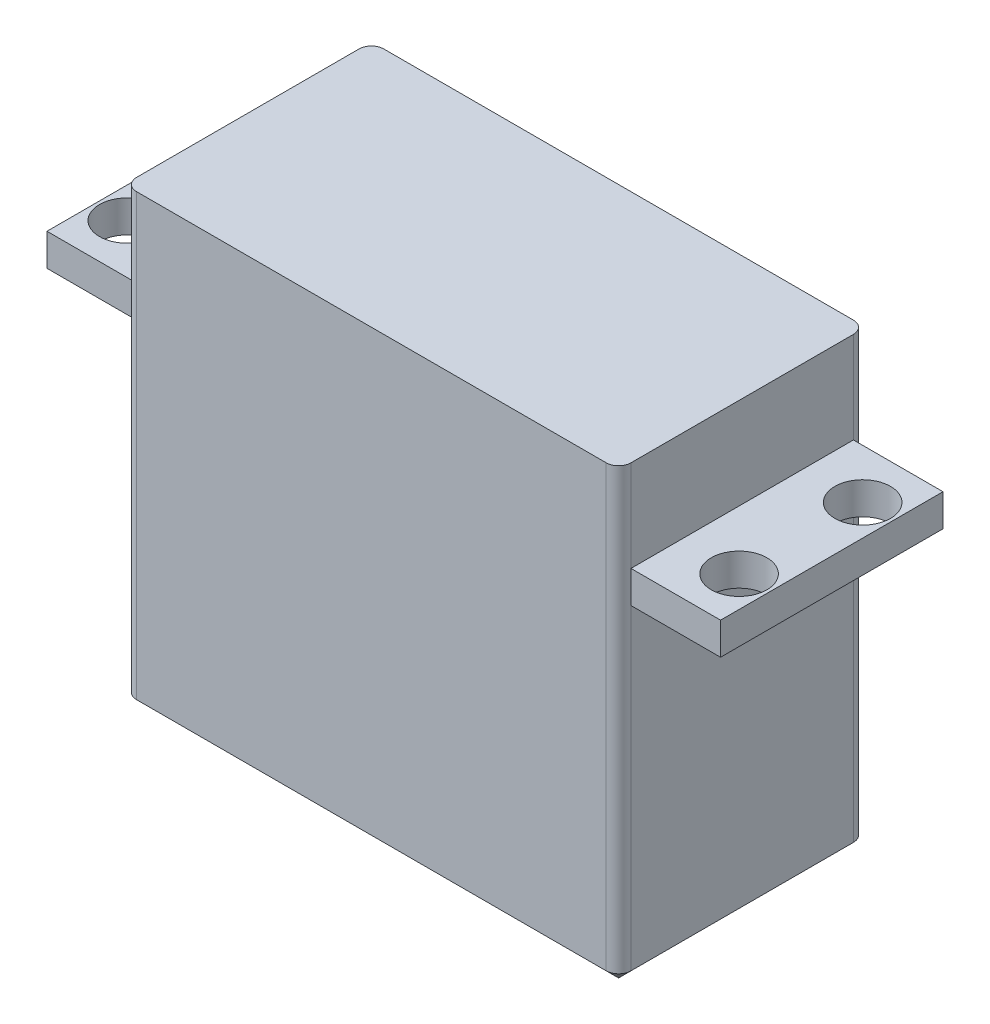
ISO-10303-21;
HEADER;
FILE_DESCRIPTION(('STEP AP214'),'2;1');
FILE_NAME('part.step','',(''),(''),'','','');
FILE_SCHEMA(('AUTOMOTIVE_DESIGN { 1 0 10303 214 1 1 1 1 }'));
ENDSEC;
DATA;
#1=APPLICATION_CONTEXT('core data for automotive mechanical design processes');
#2=APPLICATION_PROTOCOL_DEFINITION('international standard','automotive_design',2000,#1);
#3=PRODUCT_CONTEXT('',#1,'mechanical');
#4=PRODUCT('Part','Part','',(#3));
#5=PRODUCT_RELATED_PRODUCT_CATEGORY('part','',(#4));
#6=PRODUCT_DEFINITION_FORMATION('','',#4);
#7=PRODUCT_DEFINITION_CONTEXT('part definition',#1,'design');
#8=PRODUCT_DEFINITION('design','',#6,#7);
#9=PRODUCT_DEFINITION_SHAPE('','',#8);
#10=(LENGTH_UNIT() NAMED_UNIT(*) SI_UNIT(.MILLI.,.METRE.));
#11=(NAMED_UNIT(*) PLANE_ANGLE_UNIT() SI_UNIT($,.RADIAN.));
#12=(NAMED_UNIT(*) SI_UNIT($,.STERADIAN.) SOLID_ANGLE_UNIT());
#13=UNCERTAINTY_MEASURE_WITH_UNIT(LENGTH_MEASURE(1.E-05),#10,'distance_accuracy_value','');
#14=(GEOMETRIC_REPRESENTATION_CONTEXT(3) GLOBAL_UNCERTAINTY_ASSIGNED_CONTEXT((#13)) GLOBAL_UNIT_ASSIGNED_CONTEXT((#10,
#11,#12)) REPRESENTATION_CONTEXT('',''));
#15=CARTESIAN_POINT('',(0.,0.,0.));
#16=DIRECTION('',(0.,0.,1.));
#17=DIRECTION('',(1.,0.,0.));
#18=AXIS2_PLACEMENT_3D('',#15,#16,#17);
#19=CARTESIAN_POINT('',(-20.,36.6,-10.));
#20=DIRECTION('',(1.,0.,0.));
#21=DIRECTION('',(0.,0.,-1.));
#22=AXIS2_PLACEMENT_3D('',#19,#20,#21);
#23=PLANE('',#22);
#24=DIRECTION('',(0.,0.,1.));
#25=VECTOR('',#24,1.);
#26=CARTESIAN_POINT('',(-20.,36.6,-10.));
#27=LINE('',#26,#25);
#28=CARTESIAN_POINT('',(-20.,36.6,-9.));
#29=VERTEX_POINT('',#28);
#30=CARTESIAN_POINT('',(-20.,36.6,9.));
#31=VERTEX_POINT('',#30);
#32=EDGE_CURVE('E260',#29,#31,#27,.T.);
#33=ORIENTED_EDGE('',*,*,#32,.F.);
#34=DIRECTION('',(0.,-1.,0.));
#35=VECTOR('',#34,1.);
#36=CARTESIAN_POINT('',(-20.,36.6,-9.));
#37=LINE('',#36,#35);
#38=CARTESIAN_POINT('',(-20.,29.2,-9.));
#39=VERTEX_POINT('',#38);
#40=EDGE_CURVE('E307',#29,#39,#37,.T.);
#41=ORIENTED_EDGE('',*,*,#40,.T.);
#42=DIRECTION('',(0.,0.,1.));
#43=VECTOR('',#42,1.);
#44=CARTESIAN_POINT('',(-20.,29.2,9.));
#45=LINE('',#44,#43);
#46=CARTESIAN_POINT('',(-20.,29.2,9.));
#47=VERTEX_POINT('',#46);
#48=EDGE_CURVE('E198',#39,#47,#45,.T.);
#49=ORIENTED_EDGE('',*,*,#48,.T.);
#50=DIRECTION('',(0.,-1.,0.));
#51=VECTOR('',#50,1.);
#52=CARTESIAN_POINT('',(-20.,36.6,9.));
#53=LINE('',#52,#51);
#54=EDGE_CURVE('E300',#47,#31,#53,.F.);
#55=ORIENTED_EDGE('',*,*,#54,.T.);
#56=EDGE_LOOP('',(#33,#41,#49,#55));
#57=FACE_BOUND('',#56,.T.);
#58=ADVANCED_FACE('F35',(#57),#23,.F.);
#59=CARTESIAN_POINT('',(20.,36.6,-10.));
#60=DIRECTION('',(-1.,0.,0.));
#61=DIRECTION('',(0.,0.,1.));
#62=AXIS2_PLACEMENT_3D('',#59,#60,#61);
#63=PLANE('',#62);
#64=DIRECTION('',(0.,0.,-1.));
#65=VECTOR('',#64,1.);
#66=CARTESIAN_POINT('',(20.,36.6,-10.));
#67=LINE('',#66,#65);
#68=CARTESIAN_POINT('',(20.,36.6,9.));
#69=VERTEX_POINT('',#68);
#70=CARTESIAN_POINT('',(20.,36.6,-9.));
#71=VERTEX_POINT('',#70);
#72=EDGE_CURVE('E254',#69,#71,#67,.T.);
#73=ORIENTED_EDGE('',*,*,#72,.F.);
#74=DIRECTION('',(0.,-1.,0.));
#75=VECTOR('',#74,1.);
#76=CARTESIAN_POINT('',(20.,36.6,9.));
#77=LINE('',#76,#75);
#78=CARTESIAN_POINT('',(20.,29.2,9.));
#79=VERTEX_POINT('',#78);
#80=EDGE_CURVE('E280',#69,#79,#77,.T.);
#81=ORIENTED_EDGE('',*,*,#80,.T.);
#82=DIRECTION('',(0.,0.,1.));
#83=VECTOR('',#82,1.);
#84=CARTESIAN_POINT('',(20.,29.2,9.));
#85=LINE('',#84,#83);
#86=CARTESIAN_POINT('',(20.,29.2,-9.00000000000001));
#87=VERTEX_POINT('',#86);
#88=EDGE_CURVE('E226',#87,#79,#85,.T.);
#89=ORIENTED_EDGE('',*,*,#88,.F.);
#90=DIRECTION('',(0.,-1.,0.));
#91=VECTOR('',#90,1.);
#92=CARTESIAN_POINT('',(20.,36.6,-9.));
#93=LINE('',#92,#91);
#94=EDGE_CURVE('E266',#87,#71,#93,.F.);
#95=ORIENTED_EDGE('',*,*,#94,.T.);
#96=EDGE_LOOP('',(#73,#81,#89,#95));
#97=FACE_BOUND('',#96,.T.);
#98=ADVANCED_FACE('F381',(#97),#63,.F.);
#99=CARTESIAN_POINT('',(-27.25,29.2,8.99999999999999));
#100=DIRECTION('',(0.,1.,0.));
#101=DIRECTION('',(0.,0.,1.));
#102=AXIS2_PLACEMENT_3D('',#99,#100,#101);
#103=PLANE('',#102);
#104=CARTESIAN_POINT('',(-24.75,29.2,5.));
#105=DIRECTION('',(0.,1.,0.));
#106=DIRECTION('',(0.,0.,-1.));
#107=AXIS2_PLACEMENT_3D('',#104,#105,#106);
#108=CIRCLE('',#107,2.25);
#109=CARTESIAN_POINT('',(-24.75,29.2,7.25));
#110=VERTEX_POINT('',#109);
#111=EDGE_CURVE('E273',#110,#110,#108,.T.);
#112=ORIENTED_EDGE('',*,*,#111,.F.);
#113=EDGE_LOOP('',(#112));
#114=FACE_BOUND('',#113,.T.);
#115=ORIENTED_EDGE('',*,*,#48,.F.);
#116=DIRECTION('',(1.,0.,0.));
#117=VECTOR('',#116,1.);
#118=CARTESIAN_POINT('',(-27.25,29.2,-9.00000000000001));
#119=LINE('',#118,#117);
#120=CARTESIAN_POINT('',(-27.25,29.2,-9.00000000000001));
#121=VERTEX_POINT('',#120);
#122=EDGE_CURVE('E175',#121,#39,#119,.T.);
#123=ORIENTED_EDGE('',*,*,#122,.F.);
#124=DIRECTION('',(0.,0.,1.));
#125=VECTOR('',#124,1.);
#126=CARTESIAN_POINT('',(-27.25,29.2,8.99999999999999));
#127=LINE('',#126,#125);
#128=CARTESIAN_POINT('',(-27.25,29.2,8.99999999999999));
#129=VERTEX_POINT('',#128);
#130=EDGE_CURVE('E181',#121,#129,#127,.T.);
#131=ORIENTED_EDGE('',*,*,#130,.T.);
#132=DIRECTION('',(1.,0.,0.));
#133=VECTOR('',#132,1.);
#134=CARTESIAN_POINT('',(-27.25,29.2,8.99999999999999));
#135=LINE('',#134,#133);
#136=EDGE_CURVE('E162',#129,#47,#135,.T.);
#137=ORIENTED_EDGE('',*,*,#136,.T.);
#138=EDGE_LOOP('',(#115,#123,#131,#137));
#139=FACE_BOUND('',#138,.T.);
#140=CARTESIAN_POINT('',(-24.75,29.2,-5.));
#141=DIRECTION('',(0.,-1.,0.));
#142=DIRECTION('',(0.,0.,1.));
#143=AXIS2_PLACEMENT_3D('',#140,#141,#142);
#144=CIRCLE('',#143,2.25);
#145=CARTESIAN_POINT('',(-24.75,29.2,-2.75));
#146=VERTEX_POINT('',#145);
#147=EDGE_CURVE('E269',#146,#146,#144,.T.);
#148=ORIENTED_EDGE('',*,*,#147,.T.);
#149=EDGE_LOOP('',(#148));
#150=FACE_BOUND('',#149,.T.);
#151=ADVANCED_FACE('F187',(#114,#139,#150),#103,.T.);
#152=CARTESIAN_POINT('',(-27.25,26.6,8.99999999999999));
#153=DIRECTION('',(0.,-1.,0.));
#154=DIRECTION('',(0.,0.,-1.));
#155=AXIS2_PLACEMENT_3D('',#152,#153,#154);
#156=PLANE('',#155);
#157=CARTESIAN_POINT('',(-24.75,26.6,5.));
#158=DIRECTION('',(0.,-1.,0.));
#159=DIRECTION('',(0.,0.,-1.));
#160=AXIS2_PLACEMENT_3D('',#157,#158,#159);
#161=CIRCLE('',#160,2.25);
#162=CARTESIAN_POINT('',(-24.75,26.6,7.25));
#163=VERTEX_POINT('',#162);
#164=EDGE_CURVE('E270',#163,#163,#161,.T.);
#165=ORIENTED_EDGE('',*,*,#164,.F.);
#166=EDGE_LOOP('',(#165));
#167=FACE_BOUND('',#166,.T.);
#168=DIRECTION('',(0.,0.,-1.));
#169=VECTOR('',#168,1.);
#170=CARTESIAN_POINT('',(-20.,26.6,9.));
#171=LINE('',#170,#169);
#172=CARTESIAN_POINT('',(-20.,26.6,9.));
#173=VERTEX_POINT('',#172);
#174=CARTESIAN_POINT('',(-20.,26.6,-9.00000000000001));
#175=VERTEX_POINT('',#174);
#176=EDGE_CURVE('E185',#173,#175,#171,.T.);
#177=ORIENTED_EDGE('',*,*,#176,.F.);
#178=DIRECTION('',(1.,0.,0.));
#179=VECTOR('',#178,1.);
#180=CARTESIAN_POINT('',(-27.25,26.6,8.99999999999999));
#181=LINE('',#180,#179);
#182=CARTESIAN_POINT('',(-27.25,26.6,8.99999999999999));
#183=VERTEX_POINT('',#182);
#184=EDGE_CURVE('E196',#183,#173,#181,.T.);
#185=ORIENTED_EDGE('',*,*,#184,.F.);
#186=DIRECTION('',(0.,0.,-1.));
#187=VECTOR('',#186,1.);
#188=CARTESIAN_POINT('',(-27.25,26.6,8.99999999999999));
#189=LINE('',#188,#187);
#190=CARTESIAN_POINT('',(-27.25,26.6,-9.00000000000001));
#191=VERTEX_POINT('',#190);
#192=EDGE_CURVE('E184',#183,#191,#189,.T.);
#193=ORIENTED_EDGE('',*,*,#192,.T.);
#194=DIRECTION('',(1.,0.,0.));
#195=VECTOR('',#194,1.);
#196=CARTESIAN_POINT('',(-27.25,26.6,-9.00000000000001));
#197=LINE('',#196,#195);
#198=EDGE_CURVE('E206',#191,#175,#197,.T.);
#199=ORIENTED_EDGE('',*,*,#198,.T.);
#200=EDGE_LOOP('',(#177,#185,#193,#199));
#201=FACE_BOUND('',#200,.T.);
#202=CARTESIAN_POINT('',(-24.75,26.6,-5.));
#203=DIRECTION('',(0.,-1.,0.));
#204=DIRECTION('',(0.,0.,-1.));
#205=AXIS2_PLACEMENT_3D('',#202,#203,#204);
#206=CIRCLE('',#205,2.25);
#207=CARTESIAN_POINT('',(-24.75,26.6,-2.75));
#208=VERTEX_POINT('',#207);
#209=EDGE_CURVE('E199',#208,#208,#206,.F.);
#210=ORIENTED_EDGE('',*,*,#209,.T.);
#211=EDGE_LOOP('',(#210));
#212=FACE_BOUND('',#211,.T.);
#213=ADVANCED_FACE('F471',(#167,#201,#212),#156,.T.);
#214=CARTESIAN_POINT('',(27.25,26.6,8.99999999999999));
#215=DIRECTION('',(0.,1.,0.));
#216=DIRECTION('',(0.,0.,1.));
#217=AXIS2_PLACEMENT_3D('',#214,#215,#216);
#218=PLANE('',#217);
#219=DIRECTION('',(0.,0.,-1.));
#220=VECTOR('',#219,1.);
#221=CARTESIAN_POINT('',(20.,26.6,9.));
#222=LINE('',#221,#220);
#223=CARTESIAN_POINT('',(20.,26.6,8.99999999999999));
#224=VERTEX_POINT('',#223);
#225=CARTESIAN_POINT('',(20.,26.6,-9.));
#226=VERTEX_POINT('',#225);
#227=EDGE_CURVE('E235',#224,#226,#222,.T.);
#228=ORIENTED_EDGE('',*,*,#227,.T.);
#229=DIRECTION('',(-1.,0.,0.));
#230=VECTOR('',#229,1.);
#231=CARTESIAN_POINT('',(27.25,26.6,-9.00000000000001));
#232=LINE('',#231,#230);
#233=CARTESIAN_POINT('',(27.25,26.6,-9.00000000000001));
#234=VERTEX_POINT('',#233);
#235=EDGE_CURVE('E248',#234,#226,#232,.T.);
#236=ORIENTED_EDGE('',*,*,#235,.F.);
#237=DIRECTION('',(0.,0.,-1.));
#238=VECTOR('',#237,1.);
#239=CARTESIAN_POINT('',(27.25,26.6,8.99999999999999));
#240=LINE('',#239,#238);
#241=CARTESIAN_POINT('',(27.25,26.6,8.99999999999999));
#242=VERTEX_POINT('',#241);
#243=EDGE_CURVE('E225',#242,#234,#240,.T.);
#244=ORIENTED_EDGE('',*,*,#243,.F.);
#245=DIRECTION('',(-1.,0.,0.));
#246=VECTOR('',#245,1.);
#247=CARTESIAN_POINT('',(27.25,26.6,8.99999999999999));
#248=LINE('',#247,#246);
#249=EDGE_CURVE('E251',#242,#224,#248,.T.);
#250=ORIENTED_EDGE('',*,*,#249,.T.);
#251=EDGE_LOOP('',(#228,#236,#244,#250));
#252=FACE_BOUND('',#251,.T.);
#253=CARTESIAN_POINT('',(24.75,26.6,-5.));
#254=DIRECTION('',(0.,1.,0.));
#255=DIRECTION('',(0.,0.,1.));
#256=AXIS2_PLACEMENT_3D('',#253,#254,#255);
#257=CIRCLE('',#256,2.25);
#258=CARTESIAN_POINT('',(24.75,26.6,-2.75));
#259=VERTEX_POINT('',#258);
#260=EDGE_CURVE('E218',#259,#259,#257,.T.);
#261=ORIENTED_EDGE('',*,*,#260,.T.);
#262=EDGE_LOOP('',(#261));
#263=FACE_BOUND('',#262,.T.);
#264=CARTESIAN_POINT('',(24.75,26.6,5.));
#265=DIRECTION('',(0.,1.,0.));
#266=DIRECTION('',(0.,0.,1.));
#267=AXIS2_PLACEMENT_3D('',#264,#265,#266);
#268=CIRCLE('',#267,2.25);
#269=CARTESIAN_POINT('',(24.75,26.6,7.25));
#270=VERTEX_POINT('',#269);
#271=EDGE_CURVE('E212',#270,#270,#268,.F.);
#272=ORIENTED_EDGE('',*,*,#271,.F.);
#273=EDGE_LOOP('',(#272));
#274=FACE_BOUND('',#273,.T.);
#275=ADVANCED_FACE('F468',(#252,#263,#274),#218,.F.);
#276=CARTESIAN_POINT('',(27.25,29.2,8.99999999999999));
#277=DIRECTION('',(0.,-1.,0.));
#278=DIRECTION('',(0.,0.,-1.));
#279=AXIS2_PLACEMENT_3D('',#276,#277,#278);
#280=PLANE('',#279);
#281=ORIENTED_EDGE('',*,*,#88,.T.);
#282=DIRECTION('',(-1.,0.,0.));
#283=VECTOR('',#282,1.);
#284=CARTESIAN_POINT('',(27.25,29.2,8.99999999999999));
#285=LINE('',#284,#283);
#286=CARTESIAN_POINT('',(27.25,29.2,8.99999999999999));
#287=VERTEX_POINT('',#286);
#288=EDGE_CURVE('E232',#287,#79,#285,.T.);
#289=ORIENTED_EDGE('',*,*,#288,.F.);
#290=DIRECTION('',(0.,0.,1.));
#291=VECTOR('',#290,1.);
#292=CARTESIAN_POINT('',(27.25,29.2,8.99999999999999));
#293=LINE('',#292,#291);
#294=CARTESIAN_POINT('',(27.25,29.2,-9.00000000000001));
#295=VERTEX_POINT('',#294);
#296=EDGE_CURVE('E230',#295,#287,#293,.T.);
#297=ORIENTED_EDGE('',*,*,#296,.F.);
#298=DIRECTION('',(-1.,0.,0.));
#299=VECTOR('',#298,1.);
#300=CARTESIAN_POINT('',(27.25,29.2,-9.00000000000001));
#301=LINE('',#300,#299);
#302=EDGE_CURVE('E245',#295,#87,#301,.T.);
#303=ORIENTED_EDGE('',*,*,#302,.T.);
#304=EDGE_LOOP('',(#281,#289,#297,#303));
#305=FACE_BOUND('',#304,.T.);
#306=CARTESIAN_POINT('',(24.75,29.2,-5.));
#307=DIRECTION('',(0.,1.,0.));
#308=DIRECTION('',(0.,0.,1.));
#309=AXIS2_PLACEMENT_3D('',#306,#307,#308);
#310=CIRCLE('',#309,2.25);
#311=CARTESIAN_POINT('',(24.75,29.2,-2.75));
#312=VERTEX_POINT('',#311);
#313=EDGE_CURVE('E215',#312,#312,#310,.T.);
#314=ORIENTED_EDGE('',*,*,#313,.F.);
#315=EDGE_LOOP('',(#314));
#316=FACE_BOUND('',#315,.T.);
#317=CARTESIAN_POINT('',(24.75,29.2,5.));
#318=DIRECTION('',(0.,-1.,0.));
#319=DIRECTION('',(0.,0.,-1.));
#320=AXIS2_PLACEMENT_3D('',#317,#318,#319);
#321=CIRCLE('',#320,2.25);
#322=CARTESIAN_POINT('',(24.75,29.2,7.25));
#323=VERTEX_POINT('',#322);
#324=EDGE_CURVE('E174',#323,#323,#321,.T.);
#325=ORIENTED_EDGE('',*,*,#324,.T.);
#326=EDGE_LOOP('',(#325));
#327=FACE_BOUND('',#326,.T.);
#328=ADVANCED_FACE('F428',(#305,#316,#327),#280,.F.);
#329=DIRECTION('',(0.,-1.,0.));
#330=VECTOR('',#329,1.);
#331=CARTESIAN_POINT('',(20.,36.6,9.));
#332=LINE('',#331,#330);
#333=CARTESIAN_POINT('',(20.,1.,9.));
#334=VERTEX_POINT('',#333);
#335=EDGE_CURVE('E277',#224,#334,#332,.T.);
#336=ORIENTED_EDGE('',*,*,#335,.T.);
#337=DIRECTION('',(0.,0.,-1.));
#338=VECTOR('',#337,1.);
#339=CARTESIAN_POINT('',(20.,1.00000000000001,-10.));
#340=LINE('',#339,#338);
#341=CARTESIAN_POINT('',(20.,1.,-9.));
#342=VERTEX_POINT('',#341);
#343=EDGE_CURVE('E310',#334,#342,#340,.T.);
#344=ORIENTED_EDGE('',*,*,#343,.T.);
#345=DIRECTION('',(0.,-1.,0.));
#346=VECTOR('',#345,1.);
#347=CARTESIAN_POINT('',(20.,36.6,-9.));
#348=LINE('',#347,#346);
#349=EDGE_CURVE('E275',#342,#226,#348,.F.);
#350=ORIENTED_EDGE('',*,*,#349,.T.);
#351=ORIENTED_EDGE('',*,*,#227,.F.);
#352=EDGE_LOOP('',(#336,#344,#350,#351));
#353=FACE_BOUND('',#352,.T.);
#354=ADVANCED_FACE('F390',(#353),#63,.F.);
#355=CARTESIAN_POINT('',(-20.,36.6,-10.));
#356=DIRECTION('',(0.,0.,1.));
#357=DIRECTION('',(1.,0.,0.));
#358=AXIS2_PLACEMENT_3D('',#355,#356,#357);
#359=PLANE('',#358);
#360=DIRECTION('',(0.,-1.,0.));
#361=VECTOR('',#360,1.);
#362=CARTESIAN_POINT('',(19.,36.6,-10.));
#363=LINE('',#362,#361);
#364=CARTESIAN_POINT('',(19.,36.6,-10.));
#365=VERTEX_POINT('',#364);
#366=CARTESIAN_POINT('',(19.,1.,-10.));
#367=VERTEX_POINT('',#366);
#368=EDGE_CURVE('E298',#365,#367,#363,.T.);
#369=ORIENTED_EDGE('',*,*,#368,.T.);
#370=DIRECTION('',(-1.,0.,0.));
#371=VECTOR('',#370,1.);
#372=CARTESIAN_POINT('',(-20.,1.,-10.));
#373=LINE('',#372,#371);
#374=CARTESIAN_POINT('',(-19.,1.,-10.));
#375=VERTEX_POINT('',#374);
#376=EDGE_CURVE('E11',#367,#375,#373,.T.);
#377=ORIENTED_EDGE('',*,*,#376,.T.);
#378=DIRECTION('',(0.,-1.,0.));
#379=VECTOR('',#378,1.);
#380=CARTESIAN_POINT('',(-19.,36.6,-10.));
#381=LINE('',#380,#379);
#382=CARTESIAN_POINT('',(-19.,36.6,-10.));
#383=VERTEX_POINT('',#382);
#384=EDGE_CURVE('E296',#375,#383,#381,.F.);
#385=ORIENTED_EDGE('',*,*,#384,.T.);
#386=DIRECTION('',(-1.,0.,0.));
#387=VECTOR('',#386,1.);
#388=CARTESIAN_POINT('',(-20.,36.6,-10.));
#389=LINE('',#388,#387);
#390=EDGE_CURVE('E257',#365,#383,#389,.T.);
#391=ORIENTED_EDGE('',*,*,#390,.F.);
#392=EDGE_LOOP('',(#369,#377,#385,#391));
#393=FACE_BOUND('',#392,.T.);
#394=ADVANCED_FACE('F396',(#393),#359,.F.);
#395=DIRECTION('',(0.,-1.,0.));
#396=VECTOR('',#395,1.);
#397=CARTESIAN_POINT('',(-20.,36.6,-9.));
#398=LINE('',#397,#396);
#399=CARTESIAN_POINT('',(-20.,1.,-9.));
#400=VERTEX_POINT('',#399);
#401=EDGE_CURVE('E304',#175,#400,#398,.T.);
#402=ORIENTED_EDGE('',*,*,#401,.T.);
#403=DIRECTION('',(0.,0.,1.));
#404=VECTOR('',#403,1.);
#405=CARTESIAN_POINT('',(-20.,1.,-10.));
#406=LINE('',#405,#404);
#407=CARTESIAN_POINT('',(-20.,1.,9.));
#408=VERTEX_POINT('',#407);
#409=EDGE_CURVE('E324',#400,#408,#406,.T.);
#410=ORIENTED_EDGE('',*,*,#409,.T.);
#411=DIRECTION('',(0.,-1.,0.));
#412=VECTOR('',#411,1.);
#413=CARTESIAN_POINT('',(-20.,36.6,9.));
#414=LINE('',#413,#412);
#415=EDGE_CURVE('E302',#408,#173,#414,.F.);
#416=ORIENTED_EDGE('',*,*,#415,.T.);
#417=ORIENTED_EDGE('',*,*,#176,.T.);
#418=EDGE_LOOP('',(#402,#410,#416,#417));
#419=FACE_BOUND('',#418,.T.);
#420=ADVANCED_FACE('F384',(#419),#23,.F.);
#421=CARTESIAN_POINT('',(-20.,36.6,10.));
#422=DIRECTION('',(0.,0.,-1.));
#423=DIRECTION('',(-1.,0.,0.));
#424=AXIS2_PLACEMENT_3D('',#421,#422,#423);
#425=PLANE('',#424);
#426=DIRECTION('',(0.,-1.,0.));
#427=VECTOR('',#426,1.);
#428=CARTESIAN_POINT('',(-19.,36.6,10.));
#429=LINE('',#428,#427);
#430=CARTESIAN_POINT('',(-19.,36.6,10.));
#431=VERTEX_POINT('',#430);
#432=CARTESIAN_POINT('',(-19.,1.,10.));
#433=VERTEX_POINT('',#432);
#434=EDGE_CURVE('E283',#431,#433,#429,.T.);
#435=ORIENTED_EDGE('',*,*,#434,.T.);
#436=DIRECTION('',(1.,0.,0.));
#437=VECTOR('',#436,1.);
#438=CARTESIAN_POINT('',(-20.,1.,10.));
#439=LINE('',#438,#437);
#440=CARTESIAN_POINT('',(19.,1.,10.));
#441=VERTEX_POINT('',#440);
#442=EDGE_CURVE('E322',#433,#441,#439,.T.);
#443=ORIENTED_EDGE('',*,*,#442,.T.);
#444=DIRECTION('',(0.,-1.,0.));
#445=VECTOR('',#444,1.);
#446=CARTESIAN_POINT('',(19.,36.6,10.));
#447=LINE('',#446,#445);
#448=CARTESIAN_POINT('',(19.,36.6,10.));
#449=VERTEX_POINT('',#448);
#450=EDGE_CURVE('E286',#441,#449,#447,.F.);
#451=ORIENTED_EDGE('',*,*,#450,.T.);
#452=DIRECTION('',(1.,0.,0.));
#453=VECTOR('',#452,1.);
#454=CARTESIAN_POINT('',(-20.,36.6,10.));
#455=LINE('',#454,#453);
#456=EDGE_CURVE('E263',#431,#449,#455,.T.);
#457=ORIENTED_EDGE('',*,*,#456,.F.);
#458=EDGE_LOOP('',(#435,#443,#451,#457));
#459=FACE_BOUND('',#458,.T.);
#460=ADVANCED_FACE('F395',(#459),#425,.F.);
#461=CARTESIAN_POINT('',(0.,36.6,0.));
#462=DIRECTION('',(0.,1.,0.));
#463=DIRECTION('',(0.,0.,1.));
#464=AXIS2_PLACEMENT_3D('',#461,#462,#463);
#465=PLANE('',#464);
#466=ORIENTED_EDGE('',*,*,#456,.T.);
#467=CARTESIAN_POINT('',(19.,36.6,9.));
#468=DIRECTION('',(0.,1.,0.));
#469=DIRECTION('',(0.,0.,1.));
#470=AXIS2_PLACEMENT_3D('',#467,#468,#469);
#471=CIRCLE('',#470,1.);
#472=EDGE_CURVE('E294',#449,#69,#471,.T.);
#473=ORIENTED_EDGE('',*,*,#472,.T.);
#474=ORIENTED_EDGE('',*,*,#72,.T.);
#475=CARTESIAN_POINT('',(19.,36.6,-9.));
#476=DIRECTION('',(0.,1.,0.));
#477=DIRECTION('',(0.,0.,1.));
#478=AXIS2_PLACEMENT_3D('',#475,#476,#477);
#479=CIRCLE('',#478,1.);
#480=EDGE_CURVE('E292',#71,#365,#479,.T.);
#481=ORIENTED_EDGE('',*,*,#480,.T.);
#482=ORIENTED_EDGE('',*,*,#390,.T.);
#483=CARTESIAN_POINT('',(-19.,36.6,-9.));
#484=DIRECTION('',(0.,1.,0.));
#485=DIRECTION('',(0.,0.,1.));
#486=AXIS2_PLACEMENT_3D('',#483,#484,#485);
#487=CIRCLE('',#486,1.);
#488=EDGE_CURVE('E290',#383,#29,#487,.T.);
#489=ORIENTED_EDGE('',*,*,#488,.T.);
#490=ORIENTED_EDGE('',*,*,#32,.T.);
#491=CARTESIAN_POINT('',(-19.,36.6,9.));
#492=DIRECTION('',(0.,1.,0.));
#493=DIRECTION('',(0.,0.,1.));
#494=AXIS2_PLACEMENT_3D('',#491,#492,#493);
#495=CIRCLE('',#494,1.);
#496=EDGE_CURVE('E288',#31,#431,#495,.T.);
#497=ORIENTED_EDGE('',*,*,#496,.T.);
#498=EDGE_LOOP('',(#466,#473,#474,#481,#482,#489,#490,#497));
#499=FACE_BOUND('',#498,.T.);
#500=ADVANCED_FACE('F402',(#499),#465,.T.);
#501=CARTESIAN_POINT('',(0.,0.,0.));
#502=DIRECTION('',(0.,1.,0.));
#503=DIRECTION('',(0.,0.,1.));
#504=AXIS2_PLACEMENT_3D('',#501,#502,#503);
#505=PLANE('',#504);
#506=DIRECTION('',(1.,0.,0.));
#507=VECTOR('',#506,1.);
#508=CARTESIAN_POINT('',(0.,0.,-8.99999999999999));
#509=LINE('',#508,#507);
#510=CARTESIAN_POINT('',(-19.,0.,-8.99999999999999));
#511=VERTEX_POINT('',#510);
#512=CARTESIAN_POINT('',(19.,0.,-8.99999999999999));
#513=VERTEX_POINT('',#512);
#514=EDGE_CURVE('E313',#511,#513,#509,.T.);
#515=ORIENTED_EDGE('',*,*,#514,.T.);
#516=DIRECTION('',(0.,0.,1.));
#517=VECTOR('',#516,1.);
#518=CARTESIAN_POINT('',(19.,0.,0.));
#519=LINE('',#518,#517);
#520=CARTESIAN_POINT('',(19.,0.,8.99999999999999));
#521=VERTEX_POINT('',#520);
#522=EDGE_CURVE('E319',#513,#521,#519,.T.);
#523=ORIENTED_EDGE('',*,*,#522,.T.);
#524=DIRECTION('',(-1.,0.,0.));
#525=VECTOR('',#524,1.);
#526=CARTESIAN_POINT('',(0.,0.,8.99999999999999));
#527=LINE('',#526,#525);
#528=CARTESIAN_POINT('',(-19.,0.,9.));
#529=VERTEX_POINT('',#528);
#530=EDGE_CURVE('E317',#521,#529,#527,.T.);
#531=ORIENTED_EDGE('',*,*,#530,.T.);
#532=DIRECTION('',(0.,0.,-1.));
#533=VECTOR('',#532,1.);
#534=CARTESIAN_POINT('',(-19.,0.,0.));
#535=LINE('',#534,#533);
#536=EDGE_CURVE('E315',#529,#511,#535,.T.);
#537=ORIENTED_EDGE('',*,*,#536,.T.);
#538=EDGE_LOOP('',(#515,#523,#531,#537));
#539=FACE_BOUND('',#538,.T.);
#540=ADVANCED_FACE('F457',(#539),#505,.F.);
#541=CARTESIAN_POINT('',(27.25,29.2,8.99999999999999));
#542=DIRECTION('',(0.,0.,-1.));
#543=DIRECTION('',(-1.,0.,0.));
#544=AXIS2_PLACEMENT_3D('',#541,#542,#543);
#545=PLANE('',#544);
#546=DIRECTION('',(0.,-1.,0.));
#547=VECTOR('',#546,1.);
#548=CARTESIAN_POINT('',(20.,29.2,9.));
#549=LINE('',#548,#547);
#550=EDGE_CURVE('E221',#79,#224,#549,.T.);
#551=ORIENTED_EDGE('',*,*,#550,.T.);
#552=ORIENTED_EDGE('',*,*,#249,.F.);
#553=DIRECTION('',(0.,-1.,0.));
#554=VECTOR('',#553,1.);
#555=CARTESIAN_POINT('',(27.25,29.2,8.99999999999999));
#556=LINE('',#555,#554);
#557=EDGE_CURVE('E222',#287,#242,#556,.T.);
#558=ORIENTED_EDGE('',*,*,#557,.F.);
#559=ORIENTED_EDGE('',*,*,#288,.T.);
#560=EDGE_LOOP('',(#551,#552,#558,#559));
#561=FACE_BOUND('',#560,.T.);
#562=ADVANCED_FACE('F435',(#561),#545,.F.);
#563=CARTESIAN_POINT('',(27.25,29.2,-9.00000000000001));
#564=DIRECTION('',(0.,0.,1.));
#565=DIRECTION('',(1.,0.,0.));
#566=AXIS2_PLACEMENT_3D('',#563,#564,#565);
#567=PLANE('',#566);
#568=DIRECTION('',(0.,1.,0.));
#569=VECTOR('',#568,1.);
#570=CARTESIAN_POINT('',(20.,29.2,-9.));
#571=LINE('',#570,#569);
#572=EDGE_CURVE('E238',#226,#87,#571,.T.);
#573=ORIENTED_EDGE('',*,*,#572,.T.);
#574=ORIENTED_EDGE('',*,*,#302,.F.);
#575=DIRECTION('',(0.,1.,0.));
#576=VECTOR('',#575,1.);
#577=CARTESIAN_POINT('',(27.25,29.2,-9.00000000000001));
#578=LINE('',#577,#576);
#579=EDGE_CURVE('E228',#234,#295,#578,.T.);
#580=ORIENTED_EDGE('',*,*,#579,.F.);
#581=ORIENTED_EDGE('',*,*,#235,.T.);
#582=EDGE_LOOP('',(#573,#574,#580,#581));
#583=FACE_BOUND('',#582,.T.);
#584=ADVANCED_FACE('F442',(#583),#567,.F.);
#585=CARTESIAN_POINT('',(27.25,0.,0.));
#586=DIRECTION('',(1.,0.,0.));
#587=DIRECTION('',(0.,0.,-1.));
#588=AXIS2_PLACEMENT_3D('',#585,#586,#587);
#589=PLANE('',#588);
#590=ORIENTED_EDGE('',*,*,#557,.T.);
#591=ORIENTED_EDGE('',*,*,#243,.T.);
#592=ORIENTED_EDGE('',*,*,#579,.T.);
#593=ORIENTED_EDGE('',*,*,#296,.T.);
#594=EDGE_LOOP('',(#590,#591,#592,#593));
#595=FACE_BOUND('',#594,.T.);
#596=ADVANCED_FACE('F438',(#595),#589,.T.);
#597=CARTESIAN_POINT('',(24.75,0.,-5.));
#598=DIRECTION('',(0.,1.,0.));
#599=DIRECTION('',(0.,0.,1.));
#600=AXIS2_PLACEMENT_3D('',#597,#598,#599);
#601=CYLINDRICAL_SURFACE('',#600,2.25);
#602=CARTESIAN_POINT('',(24.75,29.2,-2.75));
#603=CARTESIAN_POINT('',(24.75,29.1729166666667,-2.75));
#604=CARTESIAN_POINT('',(24.75,29.1458333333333,-2.75));
#605=CARTESIAN_POINT('',(24.75,29.0916666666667,-2.75));
#606=CARTESIAN_POINT('',(24.75,29.0645833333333,-2.75));
#607=CARTESIAN_POINT('',(24.75,29.0104166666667,-2.75));
#608=CARTESIAN_POINT('',(24.75,28.9833333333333,-2.75));
#609=CARTESIAN_POINT('',(24.75,28.9291666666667,-2.75));
#610=CARTESIAN_POINT('',(24.75,28.9020833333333,-2.75));
#611=CARTESIAN_POINT('',(24.75,28.8479166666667,-2.75));
#612=CARTESIAN_POINT('',(24.75,28.8208333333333,-2.75));
#613=CARTESIAN_POINT('',(24.75,28.7666666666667,-2.75));
#614=CARTESIAN_POINT('',(24.75,28.7395833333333,-2.75));
#615=CARTESIAN_POINT('',(24.75,28.6854166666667,-2.75));
#616=CARTESIAN_POINT('',(24.75,28.6583333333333,-2.75));
#617=CARTESIAN_POINT('',(24.75,28.6041666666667,-2.75));
#618=CARTESIAN_POINT('',(24.75,28.5770833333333,-2.75));
#619=CARTESIAN_POINT('',(24.75,28.5229166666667,-2.75));
#620=CARTESIAN_POINT('',(24.75,28.4958333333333,-2.75));
#621=CARTESIAN_POINT('',(24.75,28.4416666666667,-2.75));
#622=CARTESIAN_POINT('',(24.75,28.4145833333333,-2.75));
#623=CARTESIAN_POINT('',(24.75,28.3604166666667,-2.75));
#624=CARTESIAN_POINT('',(24.75,28.3333333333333,-2.75));
#625=CARTESIAN_POINT('',(24.75,28.2791666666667,-2.75));
#626=CARTESIAN_POINT('',(24.75,28.2520833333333,-2.75));
#627=CARTESIAN_POINT('',(24.75,28.1979166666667,-2.75));
#628=CARTESIAN_POINT('',(24.75,28.1708333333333,-2.75));
#629=CARTESIAN_POINT('',(24.75,28.1166666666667,-2.75));
#630=CARTESIAN_POINT('',(24.75,28.0895833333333,-2.75));
#631=CARTESIAN_POINT('',(24.75,28.0354166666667,-2.75));
#632=CARTESIAN_POINT('',(24.75,28.0083333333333,-2.75));
#633=CARTESIAN_POINT('',(24.75,27.9541666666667,-2.75));
#634=CARTESIAN_POINT('',(24.75,27.9270833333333,-2.75));
#635=CARTESIAN_POINT('',(24.75,27.8729166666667,-2.75));
#636=CARTESIAN_POINT('',(24.75,27.8458333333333,-2.75));
#637=CARTESIAN_POINT('',(24.75,27.7916666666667,-2.75));
#638=CARTESIAN_POINT('',(24.75,27.7645833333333,-2.75));
#639=CARTESIAN_POINT('',(24.75,27.7104166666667,-2.75));
#640=CARTESIAN_POINT('',(24.75,27.6833333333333,-2.75));
#641=CARTESIAN_POINT('',(24.75,27.6291666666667,-2.75));
#642=CARTESIAN_POINT('',(24.75,27.6020833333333,-2.75));
#643=CARTESIAN_POINT('',(24.75,27.5479166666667,-2.75));
#644=CARTESIAN_POINT('',(24.75,27.5208333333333,-2.75));
#645=CARTESIAN_POINT('',(24.75,27.4666666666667,-2.75));
#646=CARTESIAN_POINT('',(24.75,27.4395833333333,-2.75));
#647=CARTESIAN_POINT('',(24.75,27.3854166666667,-2.75));
#648=CARTESIAN_POINT('',(24.75,27.3583333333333,-2.75));
#649=CARTESIAN_POINT('',(24.75,27.3041666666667,-2.75));
#650=CARTESIAN_POINT('',(24.75,27.2770833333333,-2.75));
#651=CARTESIAN_POINT('',(24.75,27.2229166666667,-2.75));
#652=CARTESIAN_POINT('',(24.75,27.1958333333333,-2.75));
#653=CARTESIAN_POINT('',(24.75,27.1416666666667,-2.75));
#654=CARTESIAN_POINT('',(24.75,27.1145833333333,-2.75));
#655=CARTESIAN_POINT('',(24.75,27.0604166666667,-2.75));
#656=CARTESIAN_POINT('',(24.75,27.0333333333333,-2.75));
#657=CARTESIAN_POINT('',(24.75,26.9791666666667,-2.75));
#658=CARTESIAN_POINT('',(24.75,26.9520833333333,-2.75));
#659=CARTESIAN_POINT('',(24.75,26.8979166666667,-2.75));
#660=CARTESIAN_POINT('',(24.75,26.8708333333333,-2.75));
#661=CARTESIAN_POINT('',(24.75,26.8166666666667,-2.75));
#662=CARTESIAN_POINT('',(24.75,26.7895833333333,-2.75));
#663=CARTESIAN_POINT('',(24.75,26.7354166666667,-2.75));
#664=CARTESIAN_POINT('',(24.75,26.7083333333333,-2.75));
#665=CARTESIAN_POINT('',(24.75,26.6541666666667,-2.75));
#666=CARTESIAN_POINT('',(24.75,26.6270833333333,-2.75));
#667=CARTESIAN_POINT('',(24.75,26.6,-2.75));
#668=B_SPLINE_CURVE_WITH_KNOTS('',3,(#602,#603,#604,#605,#606,#607,#608,#609,#610,#611,#612,
#613,#614,#615,#616,#617,#618,#619,#620,#621,#622,#623,#624,#625,#626,#627,#628,#629,#630,#631,
#632,#633,#634,#635,#636,#637,#638,#639,#640,#641,#642,#643,#644,#645,#646,#647,#648,#649,#650,
#651,#652,#653,#654,#655,#656,#657,#658,#659,#660,#661,#662,#663,#664,#665,#666,#667),
.UNSPECIFIED.,.F.,.F.,(4,2,2,2,2,2,2,2,2,2,2,2,2,2,2,2,2,2,2,2,2,2,2,2,2,2,2,2,2,2,2,2,4),(0.,
0.0812500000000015,0.162499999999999,0.243750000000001,0.324999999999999,0.40625,
0.487499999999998,0.56875,0.649999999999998,0.731249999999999,0.812500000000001,
0.893749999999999,0.975,1.05625,1.1375,1.21875,1.3,1.38125,1.4625,1.54375,1.625,1.70625,1.7875,
1.86875,1.95,2.03125,2.1125,2.19375,2.275,2.35625,2.4375,2.51875,2.6),.UNSPECIFIED.);
#669=EDGE_CURVE('BSEAM479',#312,#259,#668,.T.);
#670=ORIENTED_EDGE('',*,*,#313,.T.);
#671=ORIENTED_EDGE('',*,*,#260,.F.);
#672=ORIENTED_EDGE('',*,*,#669,.T.);
#673=ORIENTED_EDGE('',*,*,#669,.F.);
#674=EDGE_LOOP('',(#670,#672,#671,#673));
#675=FACE_BOUND('',#674,.T.);
#676=ADVANCED_FACE('F479',(#675),#601,.F.);
#677=CARTESIAN_POINT('',(24.75,0.,5.));
#678=DIRECTION('',(0.,1.,0.));
#679=DIRECTION('',(0.,0.,1.));
#680=AXIS2_PLACEMENT_3D('',#677,#678,#679);
#681=CYLINDRICAL_SURFACE('',#680,2.25);
#682=CARTESIAN_POINT('',(24.75,29.2,7.25));
#683=CARTESIAN_POINT('',(24.75,29.1729166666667,7.25));
#684=CARTESIAN_POINT('',(24.75,29.1458333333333,7.25));
#685=CARTESIAN_POINT('',(24.75,29.0916666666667,7.25));
#686=CARTESIAN_POINT('',(24.75,29.0645833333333,7.25));
#687=CARTESIAN_POINT('',(24.75,29.0104166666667,7.25));
#688=CARTESIAN_POINT('',(24.75,28.9833333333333,7.25));
#689=CARTESIAN_POINT('',(24.75,28.9291666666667,7.25));
#690=CARTESIAN_POINT('',(24.75,28.9020833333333,7.25));
#691=CARTESIAN_POINT('',(24.75,28.8479166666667,7.25));
#692=CARTESIAN_POINT('',(24.75,28.8208333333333,7.25));
#693=CARTESIAN_POINT('',(24.75,28.7666666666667,7.25));
#694=CARTESIAN_POINT('',(24.75,28.7395833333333,7.25));
#695=CARTESIAN_POINT('',(24.75,28.6854166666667,7.25));
#696=CARTESIAN_POINT('',(24.75,28.6583333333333,7.25));
#697=CARTESIAN_POINT('',(24.75,28.6041666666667,7.25));
#698=CARTESIAN_POINT('',(24.75,28.5770833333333,7.25));
#699=CARTESIAN_POINT('',(24.75,28.5229166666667,7.25));
#700=CARTESIAN_POINT('',(24.75,28.4958333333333,7.25));
#701=CARTESIAN_POINT('',(24.75,28.4416666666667,7.25));
#702=CARTESIAN_POINT('',(24.75,28.4145833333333,7.25));
#703=CARTESIAN_POINT('',(24.75,28.3604166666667,7.25));
#704=CARTESIAN_POINT('',(24.75,28.3333333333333,7.25));
#705=CARTESIAN_POINT('',(24.75,28.2791666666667,7.25));
#706=CARTESIAN_POINT('',(24.75,28.2520833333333,7.25));
#707=CARTESIAN_POINT('',(24.75,28.1979166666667,7.25));
#708=CARTESIAN_POINT('',(24.75,28.1708333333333,7.25));
#709=CARTESIAN_POINT('',(24.75,28.1166666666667,7.25));
#710=CARTESIAN_POINT('',(24.75,28.0895833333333,7.25));
#711=CARTESIAN_POINT('',(24.75,28.0354166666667,7.25));
#712=CARTESIAN_POINT('',(24.75,28.0083333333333,7.25));
#713=CARTESIAN_POINT('',(24.75,27.9541666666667,7.25));
#714=CARTESIAN_POINT('',(24.75,27.9270833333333,7.25));
#715=CARTESIAN_POINT('',(24.75,27.8729166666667,7.25));
#716=CARTESIAN_POINT('',(24.75,27.8458333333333,7.25));
#717=CARTESIAN_POINT('',(24.75,27.7916666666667,7.25));
#718=CARTESIAN_POINT('',(24.75,27.7645833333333,7.25));
#719=CARTESIAN_POINT('',(24.75,27.7104166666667,7.25));
#720=CARTESIAN_POINT('',(24.75,27.6833333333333,7.25));
#721=CARTESIAN_POINT('',(24.75,27.6291666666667,7.25));
#722=CARTESIAN_POINT('',(24.75,27.6020833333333,7.25));
#723=CARTESIAN_POINT('',(24.75,27.5479166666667,7.25));
#724=CARTESIAN_POINT('',(24.75,27.5208333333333,7.25));
#725=CARTESIAN_POINT('',(24.75,27.4666666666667,7.25));
#726=CARTESIAN_POINT('',(24.75,27.4395833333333,7.25));
#727=CARTESIAN_POINT('',(24.75,27.3854166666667,7.25));
#728=CARTESIAN_POINT('',(24.75,27.3583333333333,7.25));
#729=CARTESIAN_POINT('',(24.75,27.3041666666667,7.25));
#730=CARTESIAN_POINT('',(24.75,27.2770833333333,7.25));
#731=CARTESIAN_POINT('',(24.75,27.2229166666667,7.25));
#732=CARTESIAN_POINT('',(24.75,27.1958333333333,7.25));
#733=CARTESIAN_POINT('',(24.75,27.1416666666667,7.25));
#734=CARTESIAN_POINT('',(24.75,27.1145833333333,7.25));
#735=CARTESIAN_POINT('',(24.75,27.0604166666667,7.25));
#736=CARTESIAN_POINT('',(24.75,27.0333333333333,7.25));
#737=CARTESIAN_POINT('',(24.75,26.9791666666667,7.25));
#738=CARTESIAN_POINT('',(24.75,26.9520833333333,7.25));
#739=CARTESIAN_POINT('',(24.75,26.8979166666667,7.25));
#740=CARTESIAN_POINT('',(24.75,26.8708333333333,7.25));
#741=CARTESIAN_POINT('',(24.75,26.8166666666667,7.25));
#742=CARTESIAN_POINT('',(24.75,26.7895833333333,7.25));
#743=CARTESIAN_POINT('',(24.75,26.7354166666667,7.25));
#744=CARTESIAN_POINT('',(24.75,26.7083333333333,7.25));
#745=CARTESIAN_POINT('',(24.75,26.6541666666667,7.25));
#746=CARTESIAN_POINT('',(24.75,26.6270833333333,7.25));
#747=CARTESIAN_POINT('',(24.75,26.6,7.25));
#748=B_SPLINE_CURVE_WITH_KNOTS('',3,(#682,#683,#684,#685,#686,#687,#688,#689,#690,#691,#692,
#693,#694,#695,#696,#697,#698,#699,#700,#701,#702,#703,#704,#705,#706,#707,#708,#709,#710,#711,
#712,#713,#714,#715,#716,#717,#718,#719,#720,#721,#722,#723,#724,#725,#726,#727,#728,#729,#730,
#731,#732,#733,#734,#735,#736,#737,#738,#739,#740,#741,#742,#743,#744,#745,#746,#747),
.UNSPECIFIED.,.F.,.F.,(4,2,2,2,2,2,2,2,2,2,2,2,2,2,2,2,2,2,2,2,2,2,2,2,2,2,2,2,2,2,2,2,4),(0.,
0.0812500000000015,0.162499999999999,0.243750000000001,0.324999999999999,0.40625,
0.487500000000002,0.56875,0.650000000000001,0.731250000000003,0.812500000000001,
0.893750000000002,0.975000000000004,1.05625,1.1375,1.21875,1.3,1.38125,1.4625,1.54375,1.625,
1.70625,1.7875,1.86875,1.95,2.03125000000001,2.1125,2.19375,2.27500000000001,2.35625,
2.43750000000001,2.51875,2.6),.UNSPECIFIED.);
#749=EDGE_CURVE('BSEAM477',#323,#270,#748,.T.);
#750=ORIENTED_EDGE('',*,*,#324,.F.);
#751=ORIENTED_EDGE('',*,*,#271,.T.);
#752=ORIENTED_EDGE('',*,*,#749,.T.);
#753=ORIENTED_EDGE('',*,*,#749,.F.);
#754=EDGE_LOOP('',(#750,#752,#751,#753));
#755=FACE_BOUND('',#754,.T.);
#756=ADVANCED_FACE('F477',(#755),#681,.F.);
#757=CARTESIAN_POINT('',(-27.25,29.2,8.99999999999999));
#758=DIRECTION('',(0.,0.,1.));
#759=DIRECTION('',(1.,0.,0.));
#760=AXIS2_PLACEMENT_3D('',#757,#758,#759);
#761=PLANE('',#760);
#762=DIRECTION('',(0.,-1.,0.));
#763=VECTOR('',#762,1.);
#764=CARTESIAN_POINT('',(-20.,29.2,9.));
#765=LINE('',#764,#763);
#766=EDGE_CURVE('E169',#47,#173,#765,.T.);
#767=ORIENTED_EDGE('',*,*,#766,.F.);
#768=ORIENTED_EDGE('',*,*,#136,.F.);
#769=DIRECTION('',(0.,-1.,0.));
#770=VECTOR('',#769,1.);
#771=CARTESIAN_POINT('',(-27.25,29.2,8.99999999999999));
#772=LINE('',#771,#770);
#773=EDGE_CURVE('E166',#129,#183,#772,.T.);
#774=ORIENTED_EDGE('',*,*,#773,.T.);
#775=ORIENTED_EDGE('',*,*,#184,.T.);
#776=EDGE_LOOP('',(#767,#768,#774,#775));
#777=FACE_BOUND('',#776,.T.);
#778=ADVANCED_FACE('F164',(#777),#761,.T.);
#779=CARTESIAN_POINT('',(-27.25,29.2,-9.00000000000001));
#780=DIRECTION('',(0.,0.,-1.));
#781=DIRECTION('',(-1.,0.,0.));
#782=AXIS2_PLACEMENT_3D('',#779,#780,#781);
#783=PLANE('',#782);
#784=DIRECTION('',(0.,1.,0.));
#785=VECTOR('',#784,1.);
#786=CARTESIAN_POINT('',(-20.,29.2,-9.));
#787=LINE('',#786,#785);
#788=EDGE_CURVE('E201',#175,#39,#787,.T.);
#789=ORIENTED_EDGE('',*,*,#788,.F.);
#790=ORIENTED_EDGE('',*,*,#198,.F.);
#791=DIRECTION('',(0.,1.,0.));
#792=VECTOR('',#791,1.);
#793=CARTESIAN_POINT('',(-27.25,29.2,-9.00000000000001));
#794=LINE('',#793,#792);
#795=EDGE_CURVE('E190',#191,#121,#794,.T.);
#796=ORIENTED_EDGE('',*,*,#795,.T.);
#797=ORIENTED_EDGE('',*,*,#122,.T.);
#798=EDGE_LOOP('',(#789,#790,#796,#797));
#799=FACE_BOUND('',#798,.T.);
#800=ADVANCED_FACE('F377',(#799),#783,.T.);
#801=CARTESIAN_POINT('',(-27.25,0.,0.));
#802=DIRECTION('',(-1.,0.,0.));
#803=DIRECTION('',(0.,0.,-1.));
#804=AXIS2_PLACEMENT_3D('',#801,#802,#803);
#805=PLANE('',#804);
#806=ORIENTED_EDGE('',*,*,#773,.F.);
#807=ORIENTED_EDGE('',*,*,#130,.F.);
#808=ORIENTED_EDGE('',*,*,#795,.F.);
#809=ORIENTED_EDGE('',*,*,#192,.F.);
#810=EDGE_LOOP('',(#806,#807,#808,#809));
#811=FACE_BOUND('',#810,.T.);
#812=ADVANCED_FACE('F179',(#811),#805,.T.);
#813=CARTESIAN_POINT('',(-24.75,0.,-5.));
#814=DIRECTION('',(0.,1.,0.));
#815=DIRECTION('',(0.,0.,1.));
#816=AXIS2_PLACEMENT_3D('',#813,#814,#815);
#817=CYLINDRICAL_SURFACE('',#816,2.25);
#818=CARTESIAN_POINT('',(-24.75,26.6,-2.75));
#819=CARTESIAN_POINT('',(-24.75,26.6270833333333,-2.75));
#820=CARTESIAN_POINT('',(-24.75,26.6541666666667,-2.75));
#821=CARTESIAN_POINT('',(-24.75,26.7083333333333,-2.75));
#822=CARTESIAN_POINT('',(-24.75,26.7354166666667,-2.75));
#823=CARTESIAN_POINT('',(-24.75,26.7895833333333,-2.75));
#824=CARTESIAN_POINT('',(-24.75,26.8166666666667,-2.75));
#825=CARTESIAN_POINT('',(-24.75,26.8708333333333,-2.75));
#826=CARTESIAN_POINT('',(-24.75,26.8979166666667,-2.75));
#827=CARTESIAN_POINT('',(-24.75,26.9520833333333,-2.75));
#828=CARTESIAN_POINT('',(-24.75,26.9791666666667,-2.75));
#829=CARTESIAN_POINT('',(-24.75,27.0333333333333,-2.75));
#830=CARTESIAN_POINT('',(-24.75,27.0604166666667,-2.75));
#831=CARTESIAN_POINT('',(-24.75,27.1145833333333,-2.75));
#832=CARTESIAN_POINT('',(-24.75,27.1416666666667,-2.75));
#833=CARTESIAN_POINT('',(-24.75,27.1958333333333,-2.75));
#834=CARTESIAN_POINT('',(-24.75,27.2229166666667,-2.75));
#835=CARTESIAN_POINT('',(-24.75,27.2770833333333,-2.75));
#836=CARTESIAN_POINT('',(-24.75,27.3041666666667,-2.75));
#837=CARTESIAN_POINT('',(-24.75,27.3583333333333,-2.75));
#838=CARTESIAN_POINT('',(-24.75,27.3854166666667,-2.75));
#839=CARTESIAN_POINT('',(-24.75,27.4395833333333,-2.75));
#840=CARTESIAN_POINT('',(-24.75,27.4666666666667,-2.75));
#841=CARTESIAN_POINT('',(-24.75,27.5208333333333,-2.75));
#842=CARTESIAN_POINT('',(-24.75,27.5479166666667,-2.75));
#843=CARTESIAN_POINT('',(-24.75,27.6020833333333,-2.75));
#844=CARTESIAN_POINT('',(-24.75,27.6291666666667,-2.75));
#845=CARTESIAN_POINT('',(-24.75,27.6833333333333,-2.75));
#846=CARTESIAN_POINT('',(-24.75,27.7104166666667,-2.75));
#847=CARTESIAN_POINT('',(-24.75,27.7645833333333,-2.75));
#848=CARTESIAN_POINT('',(-24.75,27.7916666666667,-2.75));
#849=CARTESIAN_POINT('',(-24.75,27.8458333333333,-2.75));
#850=CARTESIAN_POINT('',(-24.75,27.8729166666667,-2.75));
#851=CARTESIAN_POINT('',(-24.75,27.9270833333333,-2.75));
#852=CARTESIAN_POINT('',(-24.75,27.9541666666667,-2.75));
#853=CARTESIAN_POINT('',(-24.75,28.0083333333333,-2.75));
#854=CARTESIAN_POINT('',(-24.75,28.0354166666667,-2.75));
#855=CARTESIAN_POINT('',(-24.75,28.0895833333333,-2.75));
#856=CARTESIAN_POINT('',(-24.75,28.1166666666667,-2.75));
#857=CARTESIAN_POINT('',(-24.75,28.1708333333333,-2.75));
#858=CARTESIAN_POINT('',(-24.75,28.1979166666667,-2.75));
#859=CARTESIAN_POINT('',(-24.75,28.2520833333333,-2.75));
#860=CARTESIAN_POINT('',(-24.75,28.2791666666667,-2.75));
#861=CARTESIAN_POINT('',(-24.75,28.3333333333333,-2.75));
#862=CARTESIAN_POINT('',(-24.75,28.3604166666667,-2.75));
#863=CARTESIAN_POINT('',(-24.75,28.4145833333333,-2.75));
#864=CARTESIAN_POINT('',(-24.75,28.4416666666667,-2.75));
#865=CARTESIAN_POINT('',(-24.75,28.4958333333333,-2.75));
#866=CARTESIAN_POINT('',(-24.75,28.5229166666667,-2.75));
#867=CARTESIAN_POINT('',(-24.75,28.5770833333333,-2.75));
#868=CARTESIAN_POINT('',(-24.75,28.6041666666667,-2.75));
#869=CARTESIAN_POINT('',(-24.75,28.6583333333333,-2.75));
#870=CARTESIAN_POINT('',(-24.75,28.6854166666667,-2.75));
#871=CARTESIAN_POINT('',(-24.75,28.7395833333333,-2.75));
#872=CARTESIAN_POINT('',(-24.75,28.7666666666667,-2.75));
#873=CARTESIAN_POINT('',(-24.75,28.8208333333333,-2.75));
#874=CARTESIAN_POINT('',(-24.75,28.8479166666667,-2.75));
#875=CARTESIAN_POINT('',(-24.75,28.9020833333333,-2.75));
#876=CARTESIAN_POINT('',(-24.75,28.9291666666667,-2.75));
#877=CARTESIAN_POINT('',(-24.75,28.9833333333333,-2.75));
#878=CARTESIAN_POINT('',(-24.75,29.0104166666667,-2.75));
#879=CARTESIAN_POINT('',(-24.75,29.0645833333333,-2.75));
#880=CARTESIAN_POINT('',(-24.75,29.0916666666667,-2.75));
#881=CARTESIAN_POINT('',(-24.75,29.1458333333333,-2.75));
#882=CARTESIAN_POINT('',(-24.75,29.1729166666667,-2.75));
#883=CARTESIAN_POINT('',(-24.75,29.2,-2.75));
#884=B_SPLINE_CURVE_WITH_KNOTS('',3,(#818,#819,#820,#821,#822,#823,#824,#825,#826,#827,#828,
#829,#830,#831,#832,#833,#834,#835,#836,#837,#838,#839,#840,#841,#842,#843,#844,#845,#846,#847,
#848,#849,#850,#851,#852,#853,#854,#855,#856,#857,#858,#859,#860,#861,#862,#863,#864,#865,#866,
#867,#868,#869,#870,#871,#872,#873,#874,#875,#876,#877,#878,#879,#880,#881,#882,#883),
.UNSPECIFIED.,.F.,.F.,(4,2,2,2,2,2,2,2,2,2,2,2,2,2,2,2,2,2,2,2,2,2,2,2,2,2,2,2,2,2,2,2,4),(0.,
0.0812500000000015,0.162499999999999,0.243750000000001,0.324999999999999,0.40625,
0.487500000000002,0.56875,0.650000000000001,0.731250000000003,0.812500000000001,
0.893750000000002,0.975000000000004,1.05625,1.1375,1.21875,1.3,1.38125,1.4625,1.54375,1.625,
1.70625,1.7875,1.86875,1.95,2.03125000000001,2.1125,2.19375,2.27500000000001,2.35625,
2.43750000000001,2.51875,2.6),.UNSPECIFIED.);
#885=EDGE_CURVE('BSEAM365',#208,#146,#884,.T.);
#886=ORIENTED_EDGE('',*,*,#209,.F.);
#887=ORIENTED_EDGE('',*,*,#147,.F.);
#888=ORIENTED_EDGE('',*,*,#885,.T.);
#889=ORIENTED_EDGE('',*,*,#885,.F.);
#890=EDGE_LOOP('',(#886,#888,#887,#889));
#891=FACE_BOUND('',#890,.T.);
#892=ADVANCED_FACE('F365',(#891),#817,.F.);
#893=CARTESIAN_POINT('',(-24.75,0.,5.));
#894=DIRECTION('',(0.,1.,0.));
#895=DIRECTION('',(0.,0.,1.));
#896=AXIS2_PLACEMENT_3D('',#893,#894,#895);
#897=CYLINDRICAL_SURFACE('',#896,2.25);
#898=CARTESIAN_POINT('',(-24.75,26.6,7.25));
#899=CARTESIAN_POINT('',(-24.75,26.6270833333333,7.25));
#900=CARTESIAN_POINT('',(-24.75,26.6541666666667,7.25));
#901=CARTESIAN_POINT('',(-24.75,26.7083333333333,7.25));
#902=CARTESIAN_POINT('',(-24.75,26.7354166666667,7.25));
#903=CARTESIAN_POINT('',(-24.75,26.7895833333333,7.25));
#904=CARTESIAN_POINT('',(-24.75,26.8166666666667,7.25));
#905=CARTESIAN_POINT('',(-24.75,26.8708333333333,7.25));
#906=CARTESIAN_POINT('',(-24.75,26.8979166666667,7.25));
#907=CARTESIAN_POINT('',(-24.75,26.9520833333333,7.25));
#908=CARTESIAN_POINT('',(-24.75,26.9791666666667,7.25));
#909=CARTESIAN_POINT('',(-24.75,27.0333333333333,7.25));
#910=CARTESIAN_POINT('',(-24.75,27.0604166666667,7.25));
#911=CARTESIAN_POINT('',(-24.75,27.1145833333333,7.25));
#912=CARTESIAN_POINT('',(-24.75,27.1416666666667,7.25));
#913=CARTESIAN_POINT('',(-24.75,27.1958333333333,7.25));
#914=CARTESIAN_POINT('',(-24.75,27.2229166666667,7.25));
#915=CARTESIAN_POINT('',(-24.75,27.2770833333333,7.25));
#916=CARTESIAN_POINT('',(-24.75,27.3041666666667,7.25));
#917=CARTESIAN_POINT('',(-24.75,27.3583333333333,7.25));
#918=CARTESIAN_POINT('',(-24.75,27.3854166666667,7.25));
#919=CARTESIAN_POINT('',(-24.75,27.4395833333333,7.25));
#920=CARTESIAN_POINT('',(-24.75,27.4666666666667,7.25));
#921=CARTESIAN_POINT('',(-24.75,27.5208333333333,7.25));
#922=CARTESIAN_POINT('',(-24.75,27.5479166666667,7.25));
#923=CARTESIAN_POINT('',(-24.75,27.6020833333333,7.25));
#924=CARTESIAN_POINT('',(-24.75,27.6291666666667,7.25));
#925=CARTESIAN_POINT('',(-24.75,27.6833333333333,7.25));
#926=CARTESIAN_POINT('',(-24.75,27.7104166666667,7.25));
#927=CARTESIAN_POINT('',(-24.75,27.7645833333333,7.25));
#928=CARTESIAN_POINT('',(-24.75,27.7916666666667,7.25));
#929=CARTESIAN_POINT('',(-24.75,27.8458333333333,7.25));
#930=CARTESIAN_POINT('',(-24.75,27.8729166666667,7.25));
#931=CARTESIAN_POINT('',(-24.75,27.9270833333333,7.25));
#932=CARTESIAN_POINT('',(-24.75,27.9541666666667,7.25));
#933=CARTESIAN_POINT('',(-24.75,28.0083333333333,7.25));
#934=CARTESIAN_POINT('',(-24.75,28.0354166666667,7.25));
#935=CARTESIAN_POINT('',(-24.75,28.0895833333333,7.25));
#936=CARTESIAN_POINT('',(-24.75,28.1166666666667,7.25));
#937=CARTESIAN_POINT('',(-24.75,28.1708333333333,7.25));
#938=CARTESIAN_POINT('',(-24.75,28.1979166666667,7.25));
#939=CARTESIAN_POINT('',(-24.75,28.2520833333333,7.25));
#940=CARTESIAN_POINT('',(-24.75,28.2791666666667,7.25));
#941=CARTESIAN_POINT('',(-24.75,28.3333333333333,7.25));
#942=CARTESIAN_POINT('',(-24.75,28.3604166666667,7.25));
#943=CARTESIAN_POINT('',(-24.75,28.4145833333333,7.25));
#944=CARTESIAN_POINT('',(-24.75,28.4416666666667,7.25));
#945=CARTESIAN_POINT('',(-24.75,28.4958333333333,7.25));
#946=CARTESIAN_POINT('',(-24.75,28.5229166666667,7.25));
#947=CARTESIAN_POINT('',(-24.75,28.5770833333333,7.25));
#948=CARTESIAN_POINT('',(-24.75,28.6041666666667,7.25));
#949=CARTESIAN_POINT('',(-24.75,28.6583333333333,7.25));
#950=CARTESIAN_POINT('',(-24.75,28.6854166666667,7.25));
#951=CARTESIAN_POINT('',(-24.75,28.7395833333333,7.25));
#952=CARTESIAN_POINT('',(-24.75,28.7666666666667,7.25));
#953=CARTESIAN_POINT('',(-24.75,28.8208333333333,7.25));
#954=CARTESIAN_POINT('',(-24.75,28.8479166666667,7.25));
#955=CARTESIAN_POINT('',(-24.75,28.9020833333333,7.25));
#956=CARTESIAN_POINT('',(-24.75,28.9291666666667,7.25));
#957=CARTESIAN_POINT('',(-24.75,28.9833333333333,7.25));
#958=CARTESIAN_POINT('',(-24.75,29.0104166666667,7.25));
#959=CARTESIAN_POINT('',(-24.75,29.0645833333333,7.25));
#960=CARTESIAN_POINT('',(-24.75,29.0916666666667,7.25));
#961=CARTESIAN_POINT('',(-24.75,29.1458333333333,7.25));
#962=CARTESIAN_POINT('',(-24.75,29.1729166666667,7.25));
#963=CARTESIAN_POINT('',(-24.75,29.2,7.25));
#964=B_SPLINE_CURVE_WITH_KNOTS('',3,(#898,#899,#900,#901,#902,#903,#904,#905,#906,#907,#908,
#909,#910,#911,#912,#913,#914,#915,#916,#917,#918,#919,#920,#921,#922,#923,#924,#925,#926,#927,
#928,#929,#930,#931,#932,#933,#934,#935,#936,#937,#938,#939,#940,#941,#942,#943,#944,#945,#946,
#947,#948,#949,#950,#951,#952,#953,#954,#955,#956,#957,#958,#959,#960,#961,#962,#963),
.UNSPECIFIED.,.F.,.F.,(4,2,2,2,2,2,2,2,2,2,2,2,2,2,2,2,2,2,2,2,2,2,2,2,2,2,2,2,2,2,2,2,4),(0.,
0.0812500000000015,0.162499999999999,0.243750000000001,0.324999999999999,0.40625,
0.487499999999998,0.56875,0.649999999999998,0.731249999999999,0.812500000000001,
0.893749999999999,0.975,1.05625,1.1375,1.21875,1.3,1.38125,1.4625,1.54375,1.625,1.70625,1.7875,
1.86875,1.95,2.03125,2.1125,2.19375,2.275,2.35625,2.4375,2.51875,2.6),.UNSPECIFIED.);
#965=EDGE_CURVE('BSEAM367',#163,#110,#964,.T.);
#966=ORIENTED_EDGE('',*,*,#164,.T.);
#967=ORIENTED_EDGE('',*,*,#111,.T.);
#968=ORIENTED_EDGE('',*,*,#965,.T.);
#969=ORIENTED_EDGE('',*,*,#965,.F.);
#970=EDGE_LOOP('',(#966,#968,#967,#969));
#971=FACE_BOUND('',#970,.T.);
#972=ADVANCED_FACE('F367',(#971),#897,.F.);
#973=CARTESIAN_POINT('',(19.,36.6,9.));
#974=DIRECTION('',(0.,-1.,0.));
#975=DIRECTION('',(0.,0.,-1.));
#976=AXIS2_PLACEMENT_3D('',#973,#974,#975);
#977=CYLINDRICAL_SURFACE('',#976,1.);
#978=ORIENTED_EDGE('',*,*,#450,.F.);
#979=CARTESIAN_POINT('',(19.,1.,9.));
#980=DIRECTION('',(0.,1.,0.));
#981=DIRECTION('',(0.,0.,1.));
#982=AXIS2_PLACEMENT_3D('',#979,#980,#981);
#983=CIRCLE('',#982,1.);
#984=EDGE_CURVE('E326',#441,#334,#983,.T.);
#985=ORIENTED_EDGE('',*,*,#984,.T.);
#986=ORIENTED_EDGE('',*,*,#335,.F.);
#987=ORIENTED_EDGE('',*,*,#550,.F.);
#988=ORIENTED_EDGE('',*,*,#80,.F.);
#989=ORIENTED_EDGE('',*,*,#472,.F.);
#990=EDGE_LOOP('',(#978,#985,#986,#987,#988,#989));
#991=FACE_BOUND('',#990,.T.);
#992=ADVANCED_FACE('F374',(#991),#977,.T.);
#993=CARTESIAN_POINT('',(19.,36.6,-9.));
#994=DIRECTION('',(0.,-1.,0.));
#995=DIRECTION('',(0.,0.,-1.));
#996=AXIS2_PLACEMENT_3D('',#993,#994,#995);
#997=CYLINDRICAL_SURFACE('',#996,1.);
#998=ORIENTED_EDGE('',*,*,#349,.F.);
#999=CARTESIAN_POINT('',(19.,1.,-9.));
#1000=DIRECTION('',(0.,1.,0.));
#1001=DIRECTION('',(0.,0.,1.));
#1002=AXIS2_PLACEMENT_3D('',#999,#1000,#1001);
#1003=CIRCLE('',#1002,1.);
#1004=EDGE_CURVE('E58',#342,#367,#1003,.T.);
#1005=ORIENTED_EDGE('',*,*,#1004,.T.);
#1006=ORIENTED_EDGE('',*,*,#368,.F.);
#1007=ORIENTED_EDGE('',*,*,#480,.F.);
#1008=ORIENTED_EDGE('',*,*,#94,.F.);
#1009=ORIENTED_EDGE('',*,*,#572,.F.);
#1010=EDGE_LOOP('',(#998,#1005,#1006,#1007,#1008,#1009));
#1011=FACE_BOUND('',#1010,.T.);
#1012=ADVANCED_FACE('F444',(#1011),#997,.T.);
#1013=CARTESIAN_POINT('',(-19.,36.6,-9.));
#1014=DIRECTION('',(0.,-1.,0.));
#1015=DIRECTION('',(0.,0.,-1.));
#1016=AXIS2_PLACEMENT_3D('',#1013,#1014,#1015);
#1017=CYLINDRICAL_SURFACE('',#1016,1.);
#1018=ORIENTED_EDGE('',*,*,#384,.F.);
#1019=CARTESIAN_POINT('',(-19.,1.,-9.));
#1020=DIRECTION('',(0.,1.,0.));
#1021=DIRECTION('',(0.,0.,1.));
#1022=AXIS2_PLACEMENT_3D('',#1019,#1020,#1021);
#1023=CIRCLE('',#1022,1.);
#1024=EDGE_CURVE('E44',#375,#400,#1023,.T.);
#1025=ORIENTED_EDGE('',*,*,#1024,.T.);
#1026=ORIENTED_EDGE('',*,*,#401,.F.);
#1027=ORIENTED_EDGE('',*,*,#788,.T.);
#1028=ORIENTED_EDGE('',*,*,#40,.F.);
#1029=ORIENTED_EDGE('',*,*,#488,.F.);
#1030=EDGE_LOOP('',(#1018,#1025,#1026,#1027,#1028,#1029));
#1031=FACE_BOUND('',#1030,.T.);
#1032=ADVANCED_FACE('F448',(#1031),#1017,.T.);
#1033=CARTESIAN_POINT('',(-19.,36.6,9.));
#1034=DIRECTION('',(0.,-1.,0.));
#1035=DIRECTION('',(0.,0.,-1.));
#1036=AXIS2_PLACEMENT_3D('',#1033,#1034,#1035);
#1037=CYLINDRICAL_SURFACE('',#1036,1.);
#1038=ORIENTED_EDGE('',*,*,#415,.F.);
#1039=CARTESIAN_POINT('',(-19.,1.,9.));
#1040=DIRECTION('',(0.,1.,0.));
#1041=DIRECTION('',(0.,0.,1.));
#1042=AXIS2_PLACEMENT_3D('',#1039,#1040,#1041);
#1043=CIRCLE('',#1042,1.);
#1044=EDGE_CURVE('E328',#408,#433,#1043,.T.);
#1045=ORIENTED_EDGE('',*,*,#1044,.T.);
#1046=ORIENTED_EDGE('',*,*,#434,.F.);
#1047=ORIENTED_EDGE('',*,*,#496,.F.);
#1048=ORIENTED_EDGE('',*,*,#54,.F.);
#1049=ORIENTED_EDGE('',*,*,#766,.T.);
#1050=EDGE_LOOP('',(#1038,#1045,#1046,#1047,#1048,#1049));
#1051=FACE_BOUND('',#1050,.T.);
#1052=ADVANCED_FACE('F415',(#1051),#1037,.T.);
#1053=CARTESIAN_POINT('',(-20.,1.,-10.));
#1054=DIRECTION('',(0.707106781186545,0.70710678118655,0.));
#1055=DIRECTION('',(0.,0.,1.));
#1056=AXIS2_PLACEMENT_3D('',#1053,#1054,#1055);
#1057=PLANE('',#1056);
#1058=DIRECTION('',(0.70710678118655,-0.707106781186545,0.));
#1059=VECTOR('',#1058,1.);
#1060=CARTESIAN_POINT('',(-20.,1.,9.));
#1061=LINE('',#1060,#1059);
#1062=EDGE_CURVE('E39',#408,#529,#1061,.T.);
#1063=ORIENTED_EDGE('',*,*,#1062,.F.);
#1064=ORIENTED_EDGE('',*,*,#409,.F.);
#1065=DIRECTION('',(-0.70710678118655,0.707106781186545,0.));
#1066=VECTOR('',#1065,1.);
#1067=CARTESIAN_POINT('',(-19.,0.,-9.));
#1068=LINE('',#1067,#1066);
#1069=EDGE_CURVE('E347',#511,#400,#1068,.T.);
#1070=ORIENTED_EDGE('',*,*,#1069,.F.);
#1071=ORIENTED_EDGE('',*,*,#536,.F.);
#1072=EDGE_LOOP('',(#1063,#1064,#1070,#1071));
#1073=FACE_BOUND('',#1072,.T.);
#1074=ADVANCED_FACE('F37',(#1073),#1057,.F.);
#1075=CARTESIAN_POINT('',(-19.,1.,9.));
#1076=DIRECTION('',(0.,1.,0.));
#1077=DIRECTION('',(0.,0.,1.));
#1078=AXIS2_PLACEMENT_3D('',#1075,#1076,#1077);
#1079=CONICAL_SURFACE('',#1078,1.00000000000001,0.785398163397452);
#1080=ORIENTED_EDGE('',*,*,#1044,.F.);
#1081=ORIENTED_EDGE('',*,*,#1062,.T.);
#1082=DIRECTION('',(0.,-0.707106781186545,-0.70710678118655));
#1083=VECTOR('',#1082,1.);
#1084=CARTESIAN_POINT('',(-19.,1.,10.));
#1085=LINE('',#1084,#1083);
#1086=EDGE_CURVE('E345',#433,#529,#1085,.T.);
#1087=ORIENTED_EDGE('',*,*,#1086,.F.);
#1088=EDGE_LOOP('',(#1080,#1081,#1087));
#1089=FACE_BOUND('',#1088,.T.);
#1090=ADVANCED_FACE('F411',(#1089),#1079,.T.);
#1091=CARTESIAN_POINT('',(-19.,1.,-9.));
#1092=DIRECTION('',(0.,1.,0.));
#1093=DIRECTION('',(0.,0.,1.));
#1094=AXIS2_PLACEMENT_3D('',#1091,#1092,#1093);
#1095=CONICAL_SURFACE('',#1094,1.00000000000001,0.785398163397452);
#1096=ORIENTED_EDGE('',*,*,#1069,.T.);
#1097=ORIENTED_EDGE('',*,*,#1024,.F.);
#1098=DIRECTION('',(0.,0.707106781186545,-0.70710678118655));
#1099=VECTOR('',#1098,1.);
#1100=CARTESIAN_POINT('',(-19.,0.,-8.99999999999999));
#1101=LINE('',#1100,#1099);
#1102=EDGE_CURVE('E342',#511,#375,#1101,.T.);
#1103=ORIENTED_EDGE('',*,*,#1102,.F.);
#1104=EDGE_LOOP('',(#1096,#1097,#1103));
#1105=FACE_BOUND('',#1104,.T.);
#1106=ADVANCED_FACE('F450',(#1105),#1095,.T.);
#1107=CARTESIAN_POINT('',(-20.,1.,10.));
#1108=DIRECTION('',(0.,0.70710678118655,-0.707106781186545));
#1109=DIRECTION('',(1.,0.,0.));
#1110=AXIS2_PLACEMENT_3D('',#1107,#1108,#1109);
#1111=PLANE('',#1110);
#1112=ORIENTED_EDGE('',*,*,#1086,.T.);
#1113=ORIENTED_EDGE('',*,*,#530,.F.);
#1114=DIRECTION('',(0.,-0.707106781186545,-0.70710678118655));
#1115=VECTOR('',#1114,1.);
#1116=CARTESIAN_POINT('',(19.,1.,10.));
#1117=LINE('',#1116,#1115);
#1118=EDGE_CURVE('E339',#441,#521,#1117,.T.);
#1119=ORIENTED_EDGE('',*,*,#1118,.F.);
#1120=ORIENTED_EDGE('',*,*,#442,.F.);
#1121=EDGE_LOOP('',(#1112,#1113,#1119,#1120));
#1122=FACE_BOUND('',#1121,.T.);
#1123=ADVANCED_FACE('F460',(#1122),#1111,.F.);
#1124=CARTESIAN_POINT('',(-20.,1.,-10.));
#1125=DIRECTION('',(0.,0.70710678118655,0.707106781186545));
#1126=DIRECTION('',(-1.,0.,0.));
#1127=AXIS2_PLACEMENT_3D('',#1124,#1125,#1126);
#1128=PLANE('',#1127);
#1129=ORIENTED_EDGE('',*,*,#1102,.T.);
#1130=ORIENTED_EDGE('',*,*,#376,.F.);
#1131=DIRECTION('',(0.,0.707106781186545,-0.70710678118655));
#1132=VECTOR('',#1131,1.);
#1133=CARTESIAN_POINT('',(19.,0.,-8.99999999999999));
#1134=LINE('',#1133,#1132);
#1135=EDGE_CURVE('E336',#513,#367,#1134,.T.);
#1136=ORIENTED_EDGE('',*,*,#1135,.F.);
#1137=ORIENTED_EDGE('',*,*,#514,.F.);
#1138=EDGE_LOOP('',(#1129,#1130,#1136,#1137));
#1139=FACE_BOUND('',#1138,.T.);
#1140=ADVANCED_FACE('F453',(#1139),#1128,.F.);
#1141=CARTESIAN_POINT('',(19.,1.,9.));
#1142=DIRECTION('',(0.,1.,0.));
#1143=DIRECTION('',(0.,0.,1.));
#1144=AXIS2_PLACEMENT_3D('',#1141,#1142,#1143);
#1145=CONICAL_SURFACE('',#1144,1.00000000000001,0.785398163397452);
#1146=ORIENTED_EDGE('',*,*,#984,.F.);
#1147=ORIENTED_EDGE('',*,*,#1118,.T.);
#1148=DIRECTION('',(-0.707106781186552,-0.707106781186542,0.));
#1149=VECTOR('',#1148,1.);
#1150=CARTESIAN_POINT('',(20.,1.,9.));
#1151=LINE('',#1150,#1149);
#1152=EDGE_CURVE('E334',#334,#521,#1151,.T.);
#1153=ORIENTED_EDGE('',*,*,#1152,.F.);
#1154=EDGE_LOOP('',(#1146,#1147,#1153));
#1155=FACE_BOUND('',#1154,.T.);
#1156=ADVANCED_FACE('F464',(#1155),#1145,.T.);
#1157=CARTESIAN_POINT('',(19.,1.,-9.));
#1158=DIRECTION('',(0.,1.,0.));
#1159=DIRECTION('',(0.,0.,1.));
#1160=AXIS2_PLACEMENT_3D('',#1157,#1158,#1159);
#1161=CONICAL_SURFACE('',#1160,1.00000000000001,0.785398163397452);
#1162=ORIENTED_EDGE('',*,*,#1135,.T.);
#1163=ORIENTED_EDGE('',*,*,#1004,.F.);
#1164=DIRECTION('',(0.707106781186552,0.707106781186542,0.));
#1165=VECTOR('',#1164,1.);
#1166=CARTESIAN_POINT('',(19.,0.,-9.));
#1167=LINE('',#1166,#1165);
#1168=EDGE_CURVE('E332',#513,#342,#1167,.T.);
#1169=ORIENTED_EDGE('',*,*,#1168,.F.);
#1170=EDGE_LOOP('',(#1162,#1163,#1169));
#1171=FACE_BOUND('',#1170,.T.);
#1172=ADVANCED_FACE('F653',(#1171),#1161,.T.);
#1173=CARTESIAN_POINT('',(20.,1.00000000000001,-10.));
#1174=DIRECTION('',(-0.707106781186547,0.707106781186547,0.));
#1175=DIRECTION('',(0.,0.,-1.));
#1176=AXIS2_PLACEMENT_3D('',#1173,#1174,#1175);
#1177=PLANE('',#1176);
#1178=ORIENTED_EDGE('',*,*,#1152,.T.);
#1179=ORIENTED_EDGE('',*,*,#522,.F.);
#1180=ORIENTED_EDGE('',*,*,#1168,.T.);
#1181=ORIENTED_EDGE('',*,*,#343,.F.);
#1182=EDGE_LOOP('',(#1178,#1179,#1180,#1181));
#1183=FACE_BOUND('',#1182,.T.);
#1184=ADVANCED_FACE('F650',(#1183),#1177,.F.);
#1185=CLOSED_SHELL('',(#58,#98,#151,#213,#275,#328,#354,#394,#420,#460,#500,#540,#562,#584,#596,
#676,#756,#778,#800,#812,#892,#972,#992,#1012,#1032,#1052,#1074,#1090,#1106,#1123,#1140,#1156,
#1172,#1184));
#1186=MANIFOLD_SOLID_BREP('B2',#1185);
#1187=ADVANCED_BREP_SHAPE_REPRESENTATION('',(#18,#1186),#14);
#1188=SHAPE_DEFINITION_REPRESENTATION(#9,#1187);
ENDSEC;
END-ISO-10303-21;
